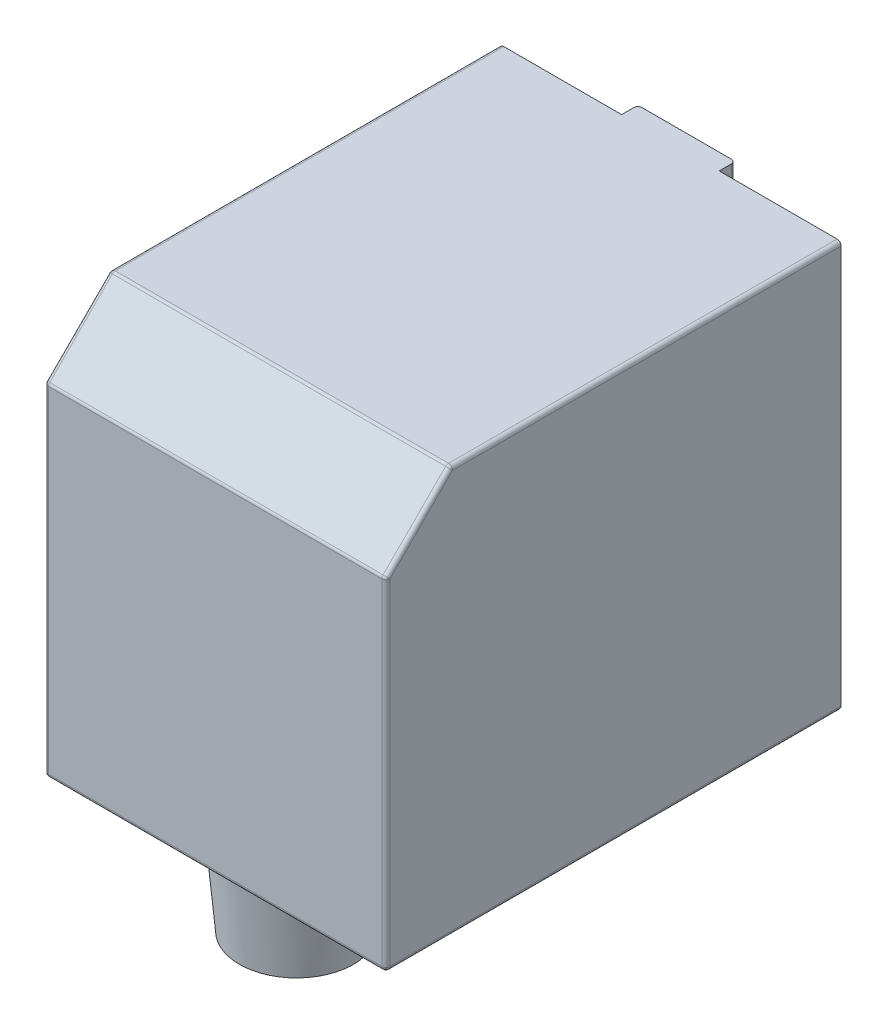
from build123d import *

# Parameters (mm, degrees)
ESQUISSE1_W             = 420
ESQUISSE1_H             = 500
EXTRUSION1_DEPTH        = 560
CHANFREIN1_SIZE         = 80
ESQUISSE2_R             = 80
EXTRUSION2_DEPTH        = 110
EXTRUSION2_TAPER        = 5
ESQUISSE3_R             = 42.5
EXTRUSION3_DEPTH        = 10
CONG_2_R                = 5
ESQUISSE5_R             = 22.5
ENL_V_MAT_EXTRU_4_DEPTH = 120
ENL_V_MAT_EXTRU_4_DRAFT = -3
ESQUISSE9_W             = 120
ESQUISSE9_H             = 495
EXTRUSION5_DEPTH        = 20
CONG_3_R                = 5


with BuildPart() as part:
    # Esquisse1 → Extrusion1 (new body)
    with BuildSketch(Plane.XY):
        with Locations((210, 250)):
            Rectangle(ESQUISSE1_W, ESQUISSE1_H)
    extrude(amount=EXTRUSION1_DEPTH)

    # Chanfrein1
    chanfrein1_edges = [part.edges().sort_by_distance(p)[0] for p in [
        (210, 500, 560),
    ]]
    chamfer(chanfrein1_edges, length=CHANFREIN1_SIZE)

    # Esquisse2 → Extrusion2 (add)
    with BuildSketch(Plane.XZ):
        with Locations((210, 460)):
            Circle(ESQUISSE2_R)
    extrude(amount=EXTRUSION2_DEPTH, taper=EXTRUSION2_TAPER)

    # Esquisse3 → Extrusion3 (add)
    with BuildSketch(Plane.XZ.offset(110)):
        with Locations(Location((210, 460, 0), (0, 0, 270))):
            Circle(ESQUISSE3_R)
    extrude(amount=EXTRUSION3_DEPTH)

    # Cong_2
    cong_2_edges = [part.edges().sort_by_distance(p)[0] for p in [
        (420, 210, 560),
        (0, 210, 560),
        (210, 420, 560),
        (0, 500, 240),
        (0, 460, 520),
        (420, 500, 240),
        (210, 500, 480),
        (420, 460, 520),
        (210, 0, 0),
        (210, 0, 560),
        (420, 0, 280),
        (0, 0, 280),
    ]]
    fillet(cong_2_edges, radius=CONG_2_R)


with BuildPart() as enl_v_mat_extru_4_tool:
    # Esquisse5 → Enl_v. mat.-Extru.4 (with draft: the straight prism first)
    with BuildSketch(Plane.XZ.offset(120)):
        with Locations((210, 460)):
            Circle(ESQUISSE5_R)
    extrude(amount=-ENL_V_MAT_EXTRU_4_DEPTH)
    # Enl_v. mat.-Extru.4: the draft: its side faces are tilted about the plane it starts from
    enl_v_mat_extru_4_sides = [enl_v_mat_extru_4_tool.faces().sort_by_distance(p)[0] for p in [
        (187.5, -60, 460),
    ]]
    draft(enl_v_mat_extru_4_sides, Plane.XZ.offset(120), ENL_V_MAT_EXTRU_4_DRAFT)


with BuildPart() as part_1:
    add(part.part)

    # Enl_v. mat.-Extru.4: cut by enl_v_mat_extru_4_tool
    add(enl_v_mat_extru_4_tool.part, mode=Mode.SUBTRACT)

    # Esquisse9 → Extrusion5 (add)
    with BuildSketch(Plane(origin=(0, 0, 0), x_dir=(-1, 0, 0), z_dir=(0, 0, -1))):
        with Locations((-210, 252.5)):
            Rectangle(ESQUISSE9_W, ESQUISSE9_H)
    extrude(amount=EXTRUSION5_DEPTH)

    # Cong_3
    cong_3_edges = [part_1.edges().sort_by_distance(p)[0] for p in [
        (270, 252.5, -20),
        (150, 252.5, -20),
    ]]
    fillet(cong_3_edges, radius=CONG_3_R)


solid = part_1.part
